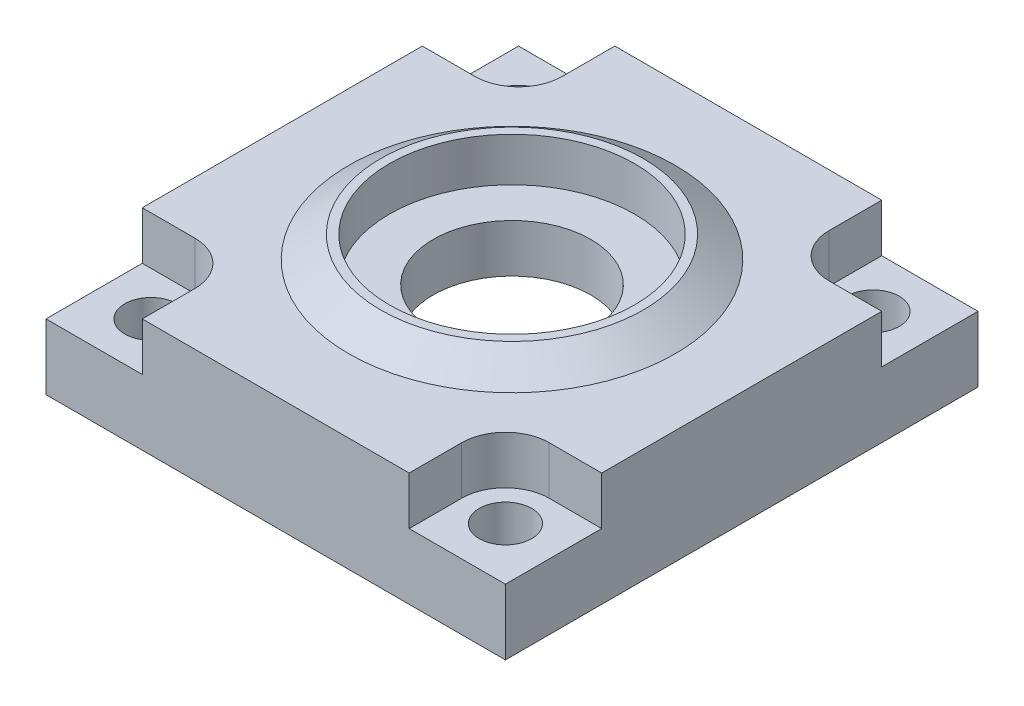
ISO-10303-21;
HEADER;
FILE_DESCRIPTION(('STEP AP214'),'2;1');
FILE_NAME('part.step','',(''),(''),'','','');
FILE_SCHEMA(('AUTOMOTIVE_DESIGN { 1 0 10303 214 1 1 1 1 }'));
ENDSEC;
DATA;
#1=APPLICATION_CONTEXT('core data for automotive mechanical design processes');
#2=APPLICATION_PROTOCOL_DEFINITION('international standard','automotive_design',2000,#1);
#3=PRODUCT_CONTEXT('',#1,'mechanical');
#4=PRODUCT('Part','Part','',(#3));
#5=PRODUCT_RELATED_PRODUCT_CATEGORY('part','',(#4));
#6=PRODUCT_DEFINITION_FORMATION('','',#4);
#7=PRODUCT_DEFINITION_CONTEXT('part definition',#1,'design');
#8=PRODUCT_DEFINITION('design','',#6,#7);
#9=PRODUCT_DEFINITION_SHAPE('','',#8);
#10=(LENGTH_UNIT() NAMED_UNIT(*) SI_UNIT(.MILLI.,.METRE.));
#11=(NAMED_UNIT(*) PLANE_ANGLE_UNIT() SI_UNIT($,.RADIAN.));
#12=(NAMED_UNIT(*) SI_UNIT($,.STERADIAN.) SOLID_ANGLE_UNIT());
#13=UNCERTAINTY_MEASURE_WITH_UNIT(LENGTH_MEASURE(1.E-05),#10,'distance_accuracy_value','');
#14=(GEOMETRIC_REPRESENTATION_CONTEXT(3) GLOBAL_UNCERTAINTY_ASSIGNED_CONTEXT((#13)) GLOBAL_UNIT_ASSIGNED_CONTEXT((#10,
#11,#12)) REPRESENTATION_CONTEXT('',''));
#15=CARTESIAN_POINT('',(0.,0.,0.));
#16=DIRECTION('',(0.,0.,1.));
#17=DIRECTION('',(1.,0.,0.));
#18=AXIS2_PLACEMENT_3D('',#15,#16,#17);
#19=CARTESIAN_POINT('',(0.,0.,-54.));
#20=DIRECTION('',(0.,-1.,0.));
#21=DIRECTION('',(0.,0.,-1.));
#22=AXIS2_PLACEMENT_3D('',#19,#20,#21);
#23=PLANE('',#22);
#24=CARTESIAN_POINT('',(46.5,0.,-48.));
#25=DIRECTION('',(0.,1.,0.));
#26=DIRECTION('',(0.,0.,-1.));
#27=AXIS2_PLACEMENT_3D('',#24,#25,#26);
#28=CIRCLE('',#27,3.);
#29=CARTESIAN_POINT('',(46.5,0.,-51.));
#30=VERTEX_POINT('',#29);
#31=EDGE_CURVE('E180',#30,#30,#28,.T.);
#32=ORIENTED_EDGE('',*,*,#31,.T.);
#33=EDGE_LOOP('',(#32));
#34=FACE_BOUND('',#33,.T.);
#35=CARTESIAN_POINT('',(46.5,0.,-6.));
#36=DIRECTION('',(0.,-1.,0.));
#37=DIRECTION('',(0.,0.,1.));
#38=AXIS2_PLACEMENT_3D('',#35,#36,#37);
#39=CIRCLE('',#38,3.);
#40=CARTESIAN_POINT('',(46.5,0.,-3.));
#41=VERTEX_POINT('',#40);
#42=EDGE_CURVE('E609',#41,#41,#39,.T.);
#43=ORIENTED_EDGE('',*,*,#42,.F.);
#44=EDGE_LOOP('',(#43));
#45=FACE_BOUND('',#44,.T.);
#46=CARTESIAN_POINT('',(6.,0.,-6.));
#47=DIRECTION('',(0.,1.,0.));
#48=DIRECTION('',(0.,0.,1.));
#49=AXIS2_PLACEMENT_3D('',#46,#47,#48);
#50=CIRCLE('',#49,3.);
#51=CARTESIAN_POINT('',(6.,0.,-3.));
#52=VERTEX_POINT('',#51);
#53=EDGE_CURVE('E522',#52,#52,#50,.T.);
#54=ORIENTED_EDGE('',*,*,#53,.T.);
#55=EDGE_LOOP('',(#54));
#56=FACE_BOUND('',#55,.T.);
#57=DIRECTION('',(1.,0.,0.));
#58=VECTOR('',#57,1.);
#59=CARTESIAN_POINT('',(0.,0.,0.));
#60=LINE('',#59,#58);
#61=CARTESIAN_POINT('',(0.,0.,0.));
#62=VERTEX_POINT('',#61);
#63=CARTESIAN_POINT('',(52.5,0.,0.));
#64=VERTEX_POINT('',#63);
#65=EDGE_CURVE('E560',#62,#64,#60,.T.);
#66=ORIENTED_EDGE('',*,*,#65,.F.);
#67=DIRECTION('',(0.,0.,1.));
#68=VECTOR('',#67,1.);
#69=CARTESIAN_POINT('',(0.,0.,-54.));
#70=LINE('',#69,#68);
#71=CARTESIAN_POINT('',(0.,0.,-54.));
#72=VERTEX_POINT('',#71);
#73=EDGE_CURVE('E187',#72,#62,#70,.T.);
#74=ORIENTED_EDGE('',*,*,#73,.F.);
#75=DIRECTION('',(1.,0.,0.));
#76=VECTOR('',#75,1.);
#77=CARTESIAN_POINT('',(0.,0.,-54.));
#78=LINE('',#77,#76);
#79=CARTESIAN_POINT('',(52.5,0.,-54.));
#80=VERTEX_POINT('',#79);
#81=EDGE_CURVE('E194',#72,#80,#78,.T.);
#82=ORIENTED_EDGE('',*,*,#81,.T.);
#83=DIRECTION('',(0.,0.,1.));
#84=VECTOR('',#83,1.);
#85=CARTESIAN_POINT('',(52.5,0.,-54.));
#86=LINE('',#85,#84);
#87=EDGE_CURVE('E191',#80,#64,#86,.T.);
#88=ORIENTED_EDGE('',*,*,#87,.T.);
#89=EDGE_LOOP('',(#66,#74,#82,#88));
#90=FACE_BOUND('',#89,.T.);
#91=CARTESIAN_POINT('',(26.25,0.,-27.));
#92=DIRECTION('',(0.,1.,0.));
#93=DIRECTION('',(0.,0.,1.));
#94=AXIS2_PLACEMENT_3D('',#91,#92,#93);
#95=CIRCLE('',#94,18.5);
#96=CARTESIAN_POINT('',(26.25,0.,-8.5));
#97=VERTEX_POINT('',#96);
#98=EDGE_CURVE('E535',#97,#97,#95,.T.);
#99=ORIENTED_EDGE('',*,*,#98,.T.);
#100=EDGE_LOOP('',(#99));
#101=FACE_BOUND('',#100,.T.);
#102=CARTESIAN_POINT('',(6.,0.,-48.));
#103=DIRECTION('',(0.,-1.,0.));
#104=DIRECTION('',(0.,0.,-1.));
#105=AXIS2_PLACEMENT_3D('',#102,#103,#104);
#106=CIRCLE('',#105,3.);
#107=CARTESIAN_POINT('',(6.,0.,-51.));
#108=VERTEX_POINT('',#107);
#109=EDGE_CURVE('E661',#108,#108,#106,.T.);
#110=ORIENTED_EDGE('',*,*,#109,.F.);
#111=EDGE_LOOP('',(#110));
#112=FACE_BOUND('',#111,.T.);
#113=ADVANCED_FACE('F29',(#34,#45,#56,#90,#101,#112),#23,.T.);
#114=CARTESIAN_POINT('',(0.,7.5,-43.));
#115=DIRECTION('',(0.,-1.,0.));
#116=DIRECTION('',(0.,0.,1.));
#117=AXIS2_PLACEMENT_3D('',#114,#115,#116);
#118=PLANE('',#117);
#119=DIRECTION('',(-1.,0.,0.));
#120=VECTOR('',#119,1.);
#121=CARTESIAN_POINT('',(0.,7.5,-43.));
#122=LINE('',#121,#120);
#123=CARTESIAN_POINT('',(5.99999999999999,7.5,-43.));
#124=VERTEX_POINT('',#123);
#125=CARTESIAN_POINT('',(0.,7.5,-43.));
#126=VERTEX_POINT('',#125);
#127=EDGE_CURVE('E592',#124,#126,#122,.T.);
#128=ORIENTED_EDGE('',*,*,#127,.F.);
#129=CARTESIAN_POINT('',(6.,7.5,-48.));
#130=DIRECTION('',(0.,-1.,0.));
#131=DIRECTION('',(0.,0.,-1.));
#132=AXIS2_PLACEMENT_3D('',#129,#130,#131);
#133=CIRCLE('',#132,5.);
#134=CARTESIAN_POINT('',(11.,7.5,-48.));
#135=VERTEX_POINT('',#134);
#136=EDGE_CURVE('E229',#124,#135,#133,.F.);
#137=ORIENTED_EDGE('',*,*,#136,.T.);
#138=DIRECTION('',(0.,0.,1.));
#139=VECTOR('',#138,1.);
#140=CARTESIAN_POINT('',(11.,7.5,-54.));
#141=LINE('',#140,#139);
#142=CARTESIAN_POINT('',(11.,7.5,-54.));
#143=VERTEX_POINT('',#142);
#144=EDGE_CURVE('E595',#143,#135,#141,.T.);
#145=ORIENTED_EDGE('',*,*,#144,.F.);
#146=DIRECTION('',(1.,0.,0.));
#147=VECTOR('',#146,1.);
#148=CARTESIAN_POINT('',(0.,7.5,-54.));
#149=LINE('',#148,#147);
#150=CARTESIAN_POINT('',(0.,7.5,-54.));
#151=VERTEX_POINT('',#150);
#152=EDGE_CURVE('E602',#151,#143,#149,.T.);
#153=ORIENTED_EDGE('',*,*,#152,.F.);
#154=DIRECTION('',(0.,0.,-1.));
#155=VECTOR('',#154,1.);
#156=CARTESIAN_POINT('',(0.,7.5,-54.));
#157=LINE('',#156,#155);
#158=EDGE_CURVE('E590',#126,#151,#157,.T.);
#159=ORIENTED_EDGE('',*,*,#158,.F.);
#160=EDGE_LOOP('',(#128,#137,#145,#153,#159));
#161=FACE_BOUND('',#160,.T.);
#162=CARTESIAN_POINT('',(6.,7.5,-48.));
#163=DIRECTION('',(0.,-1.,0.));
#164=DIRECTION('',(0.,0.,-1.));
#165=AXIS2_PLACEMENT_3D('',#162,#163,#164);
#166=CIRCLE('',#165,3.);
#167=CARTESIAN_POINT('',(6.,7.5,-51.));
#168=VERTEX_POINT('',#167);
#169=EDGE_CURVE('E657',#168,#168,#166,.T.);
#170=ORIENTED_EDGE('',*,*,#169,.T.);
#171=EDGE_LOOP('',(#170));
#172=FACE_BOUND('',#171,.T.);
#173=ADVANCED_FACE('F261',(#161,#172),#118,.F.);
#174=CARTESIAN_POINT('',(0.,13.,-54.));
#175=DIRECTION('',(0.,1.,0.));
#176=DIRECTION('',(0.,0.,1.));
#177=AXIS2_PLACEMENT_3D('',#174,#175,#176);
#178=PLANE('',#177);
#179=DIRECTION('',(1.,0.,0.));
#180=VECTOR('',#179,1.);
#181=CARTESIAN_POINT('',(52.5,13.,-43.));
#182=LINE('',#181,#180);
#183=CARTESIAN_POINT('',(46.5,13.,-43.));
#184=VERTEX_POINT('',#183);
#185=CARTESIAN_POINT('',(52.5,13.,-43.));
#186=VERTEX_POINT('',#185);
#187=EDGE_CURVE('E179',#184,#186,#182,.T.);
#188=ORIENTED_EDGE('',*,*,#187,.F.);
#189=CARTESIAN_POINT('',(46.5,13.,-48.));
#190=DIRECTION('',(0.,1.,0.));
#191=DIRECTION('',(0.,0.,1.));
#192=AXIS2_PLACEMENT_3D('',#189,#190,#191);
#193=CIRCLE('',#192,5.);
#194=CARTESIAN_POINT('',(41.5,13.,-48.));
#195=VERTEX_POINT('',#194);
#196=EDGE_CURVE('E11',#184,#195,#193,.F.);
#197=ORIENTED_EDGE('',*,*,#196,.T.);
#198=DIRECTION('',(0.,0.,1.));
#199=VECTOR('',#198,1.);
#200=CARTESIAN_POINT('',(41.5,13.,-54.));
#201=LINE('',#200,#199);
#202=CARTESIAN_POINT('',(41.5,13.,-54.));
#203=VERTEX_POINT('',#202);
#204=EDGE_CURVE('E165',#203,#195,#201,.T.);
#205=ORIENTED_EDGE('',*,*,#204,.F.);
#206=DIRECTION('',(-1.,0.,0.));
#207=VECTOR('',#206,1.);
#208=CARTESIAN_POINT('',(0.,13.,-54.));
#209=LINE('',#208,#207);
#210=CARTESIAN_POINT('',(11.,13.,-54.));
#211=VERTEX_POINT('',#210);
#212=EDGE_CURVE('E177',#203,#211,#209,.T.);
#213=ORIENTED_EDGE('',*,*,#212,.T.);
#214=DIRECTION('',(0.,0.,1.));
#215=VECTOR('',#214,1.);
#216=CARTESIAN_POINT('',(11.,13.,-54.));
#217=LINE('',#216,#215);
#218=CARTESIAN_POINT('',(11.,13.,-48.));
#219=VERTEX_POINT('',#218);
#220=EDGE_CURVE('E593',#211,#219,#217,.T.);
#221=ORIENTED_EDGE('',*,*,#220,.T.);
#222=CARTESIAN_POINT('',(6.,13.,-48.));
#223=DIRECTION('',(0.,1.,0.));
#224=DIRECTION('',(0.,0.,1.));
#225=AXIS2_PLACEMENT_3D('',#222,#223,#224);
#226=CIRCLE('',#225,5.);
#227=CARTESIAN_POINT('',(5.99999999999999,13.,-43.));
#228=VERTEX_POINT('',#227);
#229=EDGE_CURVE('E231',#219,#228,#226,.F.);
#230=ORIENTED_EDGE('',*,*,#229,.T.);
#231=DIRECTION('',(-1.,0.,0.));
#232=VECTOR('',#231,1.);
#233=CARTESIAN_POINT('',(0.,13.,-43.));
#234=LINE('',#233,#232);
#235=CARTESIAN_POINT('',(0.,13.,-43.));
#236=VERTEX_POINT('',#235);
#237=EDGE_CURVE('E513',#228,#236,#234,.T.);
#238=ORIENTED_EDGE('',*,*,#237,.T.);
#239=DIRECTION('',(0.,0.,1.));
#240=VECTOR('',#239,1.);
#241=CARTESIAN_POINT('',(0.,13.,-54.));
#242=LINE('',#241,#240);
#243=CARTESIAN_POINT('',(0.,13.,-11.));
#244=VERTEX_POINT('',#243);
#245=EDGE_CURVE('E198',#236,#244,#242,.T.);
#246=ORIENTED_EDGE('',*,*,#245,.T.);
#247=DIRECTION('',(-1.,0.,0.));
#248=VECTOR('',#247,1.);
#249=CARTESIAN_POINT('',(0.,13.,-11.));
#250=LINE('',#249,#248);
#251=CARTESIAN_POINT('',(5.99999999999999,13.,-11.));
#252=VERTEX_POINT('',#251);
#253=EDGE_CURVE('E511',#252,#244,#250,.T.);
#254=ORIENTED_EDGE('',*,*,#253,.F.);
#255=CARTESIAN_POINT('',(6.,13.,-6.));
#256=DIRECTION('',(0.,1.,0.));
#257=DIRECTION('',(0.,0.,1.));
#258=AXIS2_PLACEMENT_3D('',#255,#256,#257);
#259=CIRCLE('',#258,5.);
#260=CARTESIAN_POINT('',(11.,13.,-6.));
#261=VERTEX_POINT('',#260);
#262=EDGE_CURVE('E213',#252,#261,#259,.F.);
#263=ORIENTED_EDGE('',*,*,#262,.T.);
#264=DIRECTION('',(0.,0.,-1.));
#265=VECTOR('',#264,1.);
#266=CARTESIAN_POINT('',(11.,13.,0.));
#267=LINE('',#266,#265);
#268=CARTESIAN_POINT('',(11.,13.,0.));
#269=VERTEX_POINT('',#268);
#270=EDGE_CURVE('E517',#269,#261,#267,.T.);
#271=ORIENTED_EDGE('',*,*,#270,.F.);
#272=DIRECTION('',(-1.,0.,0.));
#273=VECTOR('',#272,1.);
#274=CARTESIAN_POINT('',(0.,13.,0.));
#275=LINE('',#274,#273);
#276=CARTESIAN_POINT('',(41.5,13.,0.));
#277=VERTEX_POINT('',#276);
#278=EDGE_CURVE('E566',#277,#269,#275,.T.);
#279=ORIENTED_EDGE('',*,*,#278,.F.);
#280=DIRECTION('',(0.,0.,-1.));
#281=VECTOR('',#280,1.);
#282=CARTESIAN_POINT('',(41.5,13.,0.));
#283=LINE('',#282,#281);
#284=CARTESIAN_POINT('',(41.5,13.,-6.));
#285=VERTEX_POINT('',#284);
#286=EDGE_CURVE('E615',#277,#285,#283,.T.);
#287=ORIENTED_EDGE('',*,*,#286,.T.);
#288=CARTESIAN_POINT('',(46.5,13.,-6.));
#289=DIRECTION('',(0.,1.,0.));
#290=DIRECTION('',(0.,0.,1.));
#291=AXIS2_PLACEMENT_3D('',#288,#289,#290);
#292=CIRCLE('',#291,5.);
#293=CARTESIAN_POINT('',(46.5,13.,-11.));
#294=VERTEX_POINT('',#293);
#295=EDGE_CURVE('E222',#285,#294,#292,.F.);
#296=ORIENTED_EDGE('',*,*,#295,.T.);
#297=DIRECTION('',(1.,0.,0.));
#298=VECTOR('',#297,1.);
#299=CARTESIAN_POINT('',(52.5,13.,-11.));
#300=LINE('',#299,#298);
#301=CARTESIAN_POINT('',(52.5,13.,-11.));
#302=VERTEX_POINT('',#301);
#303=EDGE_CURVE('E612',#294,#302,#300,.T.);
#304=ORIENTED_EDGE('',*,*,#303,.T.);
#305=DIRECTION('',(0.,0.,1.));
#306=VECTOR('',#305,1.);
#307=CARTESIAN_POINT('',(52.5,13.,-54.));
#308=LINE('',#307,#306);
#309=EDGE_CURVE('E201',#186,#302,#308,.T.);
#310=ORIENTED_EDGE('',*,*,#309,.F.);
#311=EDGE_LOOP('',(#188,#197,#205,#213,#221,#230,#238,#246,#254,#263,#271,#279,#287,#296,#304,#310));
#312=FACE_BOUND('',#311,.T.);
#313=CARTESIAN_POINT('',(26.25,13.,-27.));
#314=DIRECTION('',(0.,1.,0.));
#315=DIRECTION('',(0.,0.,1.));
#316=AXIS2_PLACEMENT_3D('',#313,#314,#315);
#317=CIRCLE('',#316,18.650692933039);
#318=CARTESIAN_POINT('',(26.25,13.,-8.34930706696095));
#319=VERTEX_POINT('',#318);
#320=EDGE_CURVE('E200',#319,#319,#317,.T.);
#321=ORIENTED_EDGE('',*,*,#320,.F.);
#322=EDGE_LOOP('',(#321));
#323=FACE_BOUND('',#322,.T.);
#324=ADVANCED_FACE('F174',(#312,#323),#178,.T.);
#325=CARTESIAN_POINT('',(0.,0.,-54.));
#326=DIRECTION('',(-1.,0.,0.));
#327=DIRECTION('',(0.,0.,1.));
#328=AXIS2_PLACEMENT_3D('',#325,#326,#327);
#329=PLANE('',#328);
#330=ORIENTED_EDGE('',*,*,#245,.F.);
#331=DIRECTION('',(0.,1.,0.));
#332=VECTOR('',#331,1.);
#333=CARTESIAN_POINT('',(0.,7.5,-43.));
#334=LINE('',#333,#332);
#335=EDGE_CURVE('E505',#126,#236,#334,.T.);
#336=ORIENTED_EDGE('',*,*,#335,.F.);
#337=ORIENTED_EDGE('',*,*,#158,.T.);
#338=DIRECTION('',(0.,-1.,0.));
#339=VECTOR('',#338,1.);
#340=CARTESIAN_POINT('',(0.,0.,-54.));
#341=LINE('',#340,#339);
#342=EDGE_CURVE('E568',#151,#72,#341,.T.);
#343=ORIENTED_EDGE('',*,*,#342,.T.);
#344=ORIENTED_EDGE('',*,*,#73,.T.);
#345=DIRECTION('',(0.,-1.,0.));
#346=VECTOR('',#345,1.);
#347=CARTESIAN_POINT('',(0.,0.,0.));
#348=LINE('',#347,#346);
#349=CARTESIAN_POINT('',(0.,7.5,0.));
#350=VERTEX_POINT('',#349);
#351=EDGE_CURVE('E558',#350,#62,#348,.T.);
#352=ORIENTED_EDGE('',*,*,#351,.F.);
#353=DIRECTION('',(0.,0.,1.));
#354=VECTOR('',#353,1.);
#355=CARTESIAN_POINT('',(0.,7.5,0.));
#356=LINE('',#355,#354);
#357=CARTESIAN_POINT('',(0.,7.5,-11.));
#358=VERTEX_POINT('',#357);
#359=EDGE_CURVE('E516',#358,#350,#356,.T.);
#360=ORIENTED_EDGE('',*,*,#359,.F.);
#361=DIRECTION('',(0.,1.,0.));
#362=VECTOR('',#361,1.);
#363=CARTESIAN_POINT('',(0.,7.5,-11.));
#364=LINE('',#363,#362);
#365=EDGE_CURVE('E508',#358,#244,#364,.T.);
#366=ORIENTED_EDGE('',*,*,#365,.T.);
#367=EDGE_LOOP('',(#330,#336,#337,#343,#344,#352,#360,#366));
#368=FACE_BOUND('',#367,.T.);
#369=ADVANCED_FACE('F31',(#368),#329,.T.);
#370=CARTESIAN_POINT('',(0.,13.,-54.));
#371=DIRECTION('',(0.,0.,-1.));
#372=DIRECTION('',(-1.,0.,0.));
#373=AXIS2_PLACEMENT_3D('',#370,#371,#372);
#374=PLANE('',#373);
#375=DIRECTION('',(0.,1.,0.));
#376=VECTOR('',#375,1.);
#377=CARTESIAN_POINT('',(41.5,7.5,-54.));
#378=LINE('',#377,#376);
#379=CARTESIAN_POINT('',(41.5,7.5,-54.));
#380=VERTEX_POINT('',#379);
#381=EDGE_CURVE('E163',#380,#203,#378,.T.);
#382=ORIENTED_EDGE('',*,*,#381,.F.);
#383=DIRECTION('',(-1.,0.,0.));
#384=VECTOR('',#383,1.);
#385=CARTESIAN_POINT('',(52.5,7.5,-54.));
#386=LINE('',#385,#384);
#387=CARTESIAN_POINT('',(52.5,7.5,-54.));
#388=VERTEX_POINT('',#387);
#389=EDGE_CURVE('E578',#388,#380,#386,.T.);
#390=ORIENTED_EDGE('',*,*,#389,.F.);
#391=DIRECTION('',(0.,1.,0.));
#392=VECTOR('',#391,1.);
#393=CARTESIAN_POINT('',(52.5,0.,-54.));
#394=LINE('',#393,#392);
#395=EDGE_CURVE('E188',#80,#388,#394,.T.);
#396=ORIENTED_EDGE('',*,*,#395,.F.);
#397=ORIENTED_EDGE('',*,*,#81,.F.);
#398=ORIENTED_EDGE('',*,*,#342,.F.);
#399=ORIENTED_EDGE('',*,*,#152,.T.);
#400=DIRECTION('',(0.,1.,0.));
#401=VECTOR('',#400,1.);
#402=CARTESIAN_POINT('',(11.,7.5,-54.));
#403=LINE('',#402,#401);
#404=EDGE_CURVE('E186',#143,#211,#403,.T.);
#405=ORIENTED_EDGE('',*,*,#404,.T.);
#406=ORIENTED_EDGE('',*,*,#212,.F.);
#407=EDGE_LOOP('',(#382,#390,#396,#397,#398,#399,#405,#406));
#408=FACE_BOUND('',#407,.T.);
#409=ADVANCED_FACE('F183',(#408),#374,.T.);
#410=CARTESIAN_POINT('',(52.5,7.5,-11.));
#411=DIRECTION('',(0.,-1.,0.));
#412=DIRECTION('',(0.,0.,-1.));
#413=AXIS2_PLACEMENT_3D('',#410,#411,#412);
#414=PLANE('',#413);
#415=DIRECTION('',(1.,0.,0.));
#416=VECTOR('',#415,1.);
#417=CARTESIAN_POINT('',(52.5,7.5,-11.));
#418=LINE('',#417,#416);
#419=CARTESIAN_POINT('',(46.5,7.5,-11.));
#420=VERTEX_POINT('',#419);
#421=CARTESIAN_POINT('',(52.5,7.5,-11.));
#422=VERTEX_POINT('',#421);
#423=EDGE_CURVE('E619',#420,#422,#418,.T.);
#424=ORIENTED_EDGE('',*,*,#423,.F.);
#425=CARTESIAN_POINT('',(46.5,7.5,-6.));
#426=DIRECTION('',(0.,-1.,0.));
#427=DIRECTION('',(0.,0.,-1.));
#428=AXIS2_PLACEMENT_3D('',#425,#426,#427);
#429=CIRCLE('',#428,5.);
#430=CARTESIAN_POINT('',(41.5,7.5,-6.));
#431=VERTEX_POINT('',#430);
#432=EDGE_CURVE('E220',#420,#431,#429,.F.);
#433=ORIENTED_EDGE('',*,*,#432,.T.);
#434=DIRECTION('',(0.,0.,-1.));
#435=VECTOR('',#434,1.);
#436=CARTESIAN_POINT('',(41.5,7.5,0.));
#437=LINE('',#436,#435);
#438=CARTESIAN_POINT('',(41.5,7.5,0.));
#439=VERTEX_POINT('',#438);
#440=EDGE_CURVE('E621',#439,#431,#437,.T.);
#441=ORIENTED_EDGE('',*,*,#440,.F.);
#442=DIRECTION('',(-1.,0.,0.));
#443=VECTOR('',#442,1.);
#444=CARTESIAN_POINT('',(52.5,7.5,0.));
#445=LINE('',#444,#443);
#446=CARTESIAN_POINT('',(52.5,7.5,0.));
#447=VERTEX_POINT('',#446);
#448=EDGE_CURVE('E624',#447,#439,#445,.T.);
#449=ORIENTED_EDGE('',*,*,#448,.F.);
#450=DIRECTION('',(0.,0.,1.));
#451=VECTOR('',#450,1.);
#452=CARTESIAN_POINT('',(52.5,7.5,0.));
#453=LINE('',#452,#451);
#454=EDGE_CURVE('E583',#422,#447,#453,.T.);
#455=ORIENTED_EDGE('',*,*,#454,.F.);
#456=EDGE_LOOP('',(#424,#433,#441,#449,#455));
#457=FACE_BOUND('',#456,.T.);
#458=CARTESIAN_POINT('',(46.5,7.5,-6.));
#459=DIRECTION('',(0.,-1.,0.));
#460=DIRECTION('',(0.,0.,1.));
#461=AXIS2_PLACEMENT_3D('',#458,#459,#460);
#462=CIRCLE('',#461,3.);
#463=CARTESIAN_POINT('',(46.5,7.5,-3.));
#464=VERTEX_POINT('',#463);
#465=EDGE_CURVE('E605',#464,#464,#462,.T.);
#466=ORIENTED_EDGE('',*,*,#465,.T.);
#467=EDGE_LOOP('',(#466));
#468=FACE_BOUND('',#467,.T.);
#469=ADVANCED_FACE('F275',(#457,#468),#414,.F.);
#470=CARTESIAN_POINT('',(52.5,0.,-54.));
#471=DIRECTION('',(1.,0.,0.));
#472=DIRECTION('',(0.,0.,-1.));
#473=AXIS2_PLACEMENT_3D('',#470,#471,#472);
#474=PLANE('',#473);
#475=DIRECTION('',(0.,1.,0.));
#476=VECTOR('',#475,1.);
#477=CARTESIAN_POINT('',(52.5,7.5,-43.));
#478=LINE('',#477,#476);
#479=CARTESIAN_POINT('',(52.5,7.5,-43.));
#480=VERTEX_POINT('',#479);
#481=EDGE_CURVE('E171',#480,#186,#478,.T.);
#482=ORIENTED_EDGE('',*,*,#481,.T.);
#483=ORIENTED_EDGE('',*,*,#309,.T.);
#484=DIRECTION('',(0.,1.,0.));
#485=VECTOR('',#484,1.);
#486=CARTESIAN_POINT('',(52.5,7.5,-11.));
#487=LINE('',#486,#485);
#488=EDGE_CURVE('E626',#422,#302,#487,.T.);
#489=ORIENTED_EDGE('',*,*,#488,.F.);
#490=ORIENTED_EDGE('',*,*,#454,.T.);
#491=DIRECTION('',(0.,1.,0.));
#492=VECTOR('',#491,1.);
#493=CARTESIAN_POINT('',(52.5,0.,0.));
#494=LINE('',#493,#492);
#495=EDGE_CURVE('E563',#64,#447,#494,.T.);
#496=ORIENTED_EDGE('',*,*,#495,.F.);
#497=ORIENTED_EDGE('',*,*,#87,.F.);
#498=ORIENTED_EDGE('',*,*,#395,.T.);
#499=DIRECTION('',(0.,0.,-1.));
#500=VECTOR('',#499,1.);
#501=CARTESIAN_POINT('',(52.5,7.5,-54.));
#502=LINE('',#501,#500);
#503=EDGE_CURVE('E579',#480,#388,#502,.T.);
#504=ORIENTED_EDGE('',*,*,#503,.F.);
#505=EDGE_LOOP('',(#482,#483,#489,#490,#496,#497,#498,#504));
#506=FACE_BOUND('',#505,.T.);
#507=ADVANCED_FACE('F271',(#506),#474,.T.);
#508=CARTESIAN_POINT('',(0.,13.,0.));
#509=DIRECTION('',(0.,0.,-1.));
#510=DIRECTION('',(-1.,0.,0.));
#511=AXIS2_PLACEMENT_3D('',#508,#509,#510);
#512=PLANE('',#511);
#513=DIRECTION('',(0.,1.,0.));
#514=VECTOR('',#513,1.);
#515=CARTESIAN_POINT('',(41.5,7.5,0.));
#516=LINE('',#515,#514);
#517=EDGE_CURVE('E627',#439,#277,#516,.T.);
#518=ORIENTED_EDGE('',*,*,#517,.T.);
#519=ORIENTED_EDGE('',*,*,#278,.T.);
#520=DIRECTION('',(0.,1.,0.));
#521=VECTOR('',#520,1.);
#522=CARTESIAN_POINT('',(11.,7.5,0.));
#523=LINE('',#522,#521);
#524=CARTESIAN_POINT('',(11.,7.5,0.));
#525=VERTEX_POINT('',#524);
#526=EDGE_CURVE('E533',#525,#269,#523,.T.);
#527=ORIENTED_EDGE('',*,*,#526,.F.);
#528=DIRECTION('',(1.,0.,0.));
#529=VECTOR('',#528,1.);
#530=CARTESIAN_POINT('',(0.,7.5,0.));
#531=LINE('',#530,#529);
#532=EDGE_CURVE('E519',#350,#525,#531,.T.);
#533=ORIENTED_EDGE('',*,*,#532,.F.);
#534=ORIENTED_EDGE('',*,*,#351,.T.);
#535=ORIENTED_EDGE('',*,*,#65,.T.);
#536=ORIENTED_EDGE('',*,*,#495,.T.);
#537=ORIENTED_EDGE('',*,*,#448,.T.);
#538=EDGE_LOOP('',(#518,#519,#527,#533,#534,#535,#536,#537));
#539=FACE_BOUND('',#538,.T.);
#540=ADVANCED_FACE('F274',(#539),#512,.F.);
#541=CARTESIAN_POINT('',(11.25,15.5,-27.));
#542=DIRECTION('',(0.,1.,0.));
#543=DIRECTION('',(0.,0.,1.));
#544=AXIS2_PLACEMENT_3D('',#541,#542,#543);
#545=PLANE('',#544);
#546=CARTESIAN_POINT('',(26.25,15.5,-27.));
#547=DIRECTION('',(0.,1.,0.));
#548=DIRECTION('',(0.,0.,1.));
#549=AXIS2_PLACEMENT_3D('',#546,#547,#548);
#550=CIRCLE('',#549,15.);
#551=CARTESIAN_POINT('',(26.25,15.5,-12.));
#552=VERTEX_POINT('',#551);
#553=EDGE_CURVE('E555',#552,#552,#550,.T.);
#554=ORIENTED_EDGE('',*,*,#553,.T.);
#555=EDGE_LOOP('',(#554));
#556=FACE_BOUND('',#555,.T.);
#557=CARTESIAN_POINT('',(26.25,15.5,-27.));
#558=DIRECTION('',(0.,1.,0.));
#559=DIRECTION('',(0.,0.,1.));
#560=AXIS2_PLACEMENT_3D('',#557,#558,#559);
#561=CIRCLE('',#560,14.);
#562=CARTESIAN_POINT('',(26.25,15.5,-13.));
#563=VERTEX_POINT('',#562);
#564=EDGE_CURVE('E552',#563,#563,#561,.T.);
#565=ORIENTED_EDGE('',*,*,#564,.F.);
#566=EDGE_LOOP('',(#565));
#567=FACE_BOUND('',#566,.T.);
#568=ADVANCED_FACE('F283',(#556,#567),#545,.T.);
#569=CARTESIAN_POINT('',(26.25,15.5,-27.));
#570=DIRECTION('',(0.,-1.,0.));
#571=DIRECTION('',(0.,0.,-1.));
#572=AXIS2_PLACEMENT_3D('',#569,#570,#571);
#573=CONICAL_SURFACE('',#572,15.,0.970343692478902);
#574=ORIENTED_EDGE('',*,*,#320,.T.);
#575=EDGE_LOOP('',(#574));
#576=FACE_BOUND('',#575,.T.);
#577=ORIENTED_EDGE('',*,*,#553,.F.);
#578=EDGE_LOOP('',(#577));
#579=FACE_BOUND('',#578,.T.);
#580=ADVANCED_FACE('F287',(#576,#579),#573,.T.);
#581=CARTESIAN_POINT('',(26.25,17.1514382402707,-27.));
#582=DIRECTION('',(0.,1.,0.));
#583=DIRECTION('',(0.,0.,1.));
#584=AXIS2_PLACEMENT_3D('',#581,#582,#583);
#585=CYLINDRICAL_SURFACE('',#584,14.);
#586=ORIENTED_EDGE('',*,*,#564,.T.);
#587=EDGE_LOOP('',(#586));
#588=FACE_BOUND('',#587,.T.);
#589=CARTESIAN_POINT('',(26.25,10.5,-27.));
#590=DIRECTION('',(0.,1.,0.));
#591=DIRECTION('',(0.,0.,1.));
#592=AXIS2_PLACEMENT_3D('',#589,#590,#591);
#593=CIRCLE('',#592,14.);
#594=CARTESIAN_POINT('',(26.25,10.5,-13.));
#595=VERTEX_POINT('',#594);
#596=EDGE_CURVE('E549',#595,#595,#593,.T.);
#597=ORIENTED_EDGE('',*,*,#596,.F.);
#598=EDGE_LOOP('',(#597));
#599=FACE_BOUND('',#598,.T.);
#600=ADVANCED_FACE('F291',(#588,#599),#585,.F.);
#601=CARTESIAN_POINT('',(40.25,10.5,-27.));
#602=DIRECTION('',(0.,1.,0.));
#603=DIRECTION('',(0.,0.,1.));
#604=AXIS2_PLACEMENT_3D('',#601,#602,#603);
#605=PLANE('',#604);
#606=ORIENTED_EDGE('',*,*,#596,.T.);
#607=EDGE_LOOP('',(#606));
#608=FACE_BOUND('',#607,.T.);
#609=CARTESIAN_POINT('',(26.25,10.5,-27.));
#610=DIRECTION('',(0.,1.,0.));
#611=DIRECTION('',(0.,0.,1.));
#612=AXIS2_PLACEMENT_3D('',#609,#610,#611);
#613=CIRCLE('',#612,9.00000000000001);
#614=CARTESIAN_POINT('',(26.25,10.5,-18.));
#615=VERTEX_POINT('',#614);
#616=EDGE_CURVE('E546',#615,#615,#613,.T.);
#617=ORIENTED_EDGE('',*,*,#616,.F.);
#618=EDGE_LOOP('',(#617));
#619=FACE_BOUND('',#618,.T.);
#620=ADVANCED_FACE('F295',(#608,#619),#605,.T.);
#621=CARTESIAN_POINT('',(26.25,17.1514382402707,-27.));
#622=DIRECTION('',(0.,1.,0.));
#623=DIRECTION('',(0.,0.,1.));
#624=AXIS2_PLACEMENT_3D('',#621,#622,#623);
#625=CYLINDRICAL_SURFACE('',#624,9.00000000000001);
#626=ORIENTED_EDGE('',*,*,#616,.T.);
#627=EDGE_LOOP('',(#626));
#628=FACE_BOUND('',#627,.T.);
#629=CARTESIAN_POINT('',(26.25,5.,-27.));
#630=DIRECTION('',(0.,1.,0.));
#631=DIRECTION('',(0.,0.,1.));
#632=AXIS2_PLACEMENT_3D('',#629,#630,#631);
#633=CIRCLE('',#632,9.00000000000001);
#634=CARTESIAN_POINT('',(26.25,5.,-18.));
#635=VERTEX_POINT('',#634);
#636=EDGE_CURVE('E543',#635,#635,#633,.T.);
#637=ORIENTED_EDGE('',*,*,#636,.F.);
#638=EDGE_LOOP('',(#637));
#639=FACE_BOUND('',#638,.T.);
#640=ADVANCED_FACE('F299',(#628,#639),#625,.F.);
#641=CARTESIAN_POINT('',(35.25,5.,-27.));
#642=DIRECTION('',(0.,-1.,0.));
#643=DIRECTION('',(0.,0.,-1.));
#644=AXIS2_PLACEMENT_3D('',#641,#642,#643);
#645=PLANE('',#644);
#646=ORIENTED_EDGE('',*,*,#636,.T.);
#647=EDGE_LOOP('',(#646));
#648=FACE_BOUND('',#647,.T.);
#649=CARTESIAN_POINT('',(26.25,5.,-27.));
#650=DIRECTION('',(0.,1.,0.));
#651=DIRECTION('',(0.,0.,1.));
#652=AXIS2_PLACEMENT_3D('',#649,#650,#651);
#653=CIRCLE('',#652,18.5);
#654=CARTESIAN_POINT('',(26.25,5.,-8.5));
#655=VERTEX_POINT('',#654);
#656=EDGE_CURVE('E540',#655,#655,#653,.T.);
#657=ORIENTED_EDGE('',*,*,#656,.F.);
#658=EDGE_LOOP('',(#657));
#659=FACE_BOUND('',#658,.T.);
#660=ADVANCED_FACE('F303',(#648,#659),#645,.T.);
#661=CARTESIAN_POINT('',(26.25,17.1514382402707,-27.));
#662=DIRECTION('',(0.,1.,0.));
#663=DIRECTION('',(0.,0.,1.));
#664=AXIS2_PLACEMENT_3D('',#661,#662,#663);
#665=CYLINDRICAL_SURFACE('',#664,18.5);
#666=ORIENTED_EDGE('',*,*,#656,.T.);
#667=EDGE_LOOP('',(#666));
#668=FACE_BOUND('',#667,.T.);
#669=ORIENTED_EDGE('',*,*,#98,.F.);
#670=EDGE_LOOP('',(#669));
#671=FACE_BOUND('',#670,.T.);
#672=ADVANCED_FACE('F307',(#668,#671),#665,.F.);
#673=CARTESIAN_POINT('',(0.,7.5,-11.));
#674=DIRECTION('',(0.,0.,-1.));
#675=DIRECTION('',(-1.,0.,0.));
#676=AXIS2_PLACEMENT_3D('',#673,#674,#675);
#677=PLANE('',#676);
#678=DIRECTION('',(-1.,0.,0.));
#679=VECTOR('',#678,1.);
#680=CARTESIAN_POINT('',(0.,7.5,-11.));
#681=LINE('',#680,#679);
#682=CARTESIAN_POINT('',(5.99999999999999,7.5,-11.));
#683=VERTEX_POINT('',#682);
#684=EDGE_CURVE('E531',#683,#358,#681,.T.);
#685=ORIENTED_EDGE('',*,*,#684,.F.);
#686=DIRECTION('',(0.,1.,0.));
#687=VECTOR('',#686,1.);
#688=CARTESIAN_POINT('',(5.99999999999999,13.,-11.));
#689=LINE('',#688,#687);
#690=EDGE_CURVE('E206',#683,#252,#689,.T.);
#691=ORIENTED_EDGE('',*,*,#690,.T.);
#692=ORIENTED_EDGE('',*,*,#253,.T.);
#693=ORIENTED_EDGE('',*,*,#365,.F.);
#694=EDGE_LOOP('',(#685,#691,#692,#693));
#695=FACE_BOUND('',#694,.T.);
#696=ADVANCED_FACE('F311',(#695),#677,.F.);
#697=CARTESIAN_POINT('',(11.,7.5,0.));
#698=DIRECTION('',(1.,0.,0.));
#699=DIRECTION('',(0.,0.,-1.));
#700=AXIS2_PLACEMENT_3D('',#697,#698,#699);
#701=PLANE('',#700);
#702=ORIENTED_EDGE('',*,*,#270,.T.);
#703=DIRECTION('',(0.,1.,0.));
#704=VECTOR('',#703,1.);
#705=CARTESIAN_POINT('',(11.,7.5,-6.));
#706=LINE('',#705,#704);
#707=CARTESIAN_POINT('',(11.,7.5,-6.));
#708=VERTEX_POINT('',#707);
#709=EDGE_CURVE('E209',#261,#708,#706,.F.);
#710=ORIENTED_EDGE('',*,*,#709,.T.);
#711=DIRECTION('',(0.,0.,-1.));
#712=VECTOR('',#711,1.);
#713=CARTESIAN_POINT('',(11.,7.5,0.));
#714=LINE('',#713,#712);
#715=EDGE_CURVE('E528',#525,#708,#714,.T.);
#716=ORIENTED_EDGE('',*,*,#715,.F.);
#717=ORIENTED_EDGE('',*,*,#526,.T.);
#718=EDGE_LOOP('',(#702,#710,#716,#717));
#719=FACE_BOUND('',#718,.T.);
#720=ADVANCED_FACE('F313',(#719),#701,.F.);
#721=CARTESIAN_POINT('',(0.,7.5,-11.));
#722=DIRECTION('',(0.,-1.,0.));
#723=DIRECTION('',(0.,0.,-1.));
#724=AXIS2_PLACEMENT_3D('',#721,#722,#723);
#725=PLANE('',#724);
#726=CARTESIAN_POINT('',(6.,7.5,-6.));
#727=DIRECTION('',(0.,1.,0.));
#728=DIRECTION('',(0.,0.,1.));
#729=AXIS2_PLACEMENT_3D('',#726,#727,#728);
#730=CIRCLE('',#729,3.);
#731=CARTESIAN_POINT('',(6.,7.5,-3.));
#732=VERTEX_POINT('',#731);
#733=EDGE_CURVE('E629',#732,#732,#730,.T.);
#734=ORIENTED_EDGE('',*,*,#733,.F.);
#735=EDGE_LOOP('',(#734));
#736=FACE_BOUND('',#735,.T.);
#737=ORIENTED_EDGE('',*,*,#715,.T.);
#738=CARTESIAN_POINT('',(6.,7.5,-6.));
#739=DIRECTION('',(0.,-1.,0.));
#740=DIRECTION('',(0.,0.,-1.));
#741=AXIS2_PLACEMENT_3D('',#738,#739,#740);
#742=CIRCLE('',#741,5.);
#743=EDGE_CURVE('E211',#708,#683,#742,.F.);
#744=ORIENTED_EDGE('',*,*,#743,.T.);
#745=ORIENTED_EDGE('',*,*,#684,.T.);
#746=ORIENTED_EDGE('',*,*,#359,.T.);
#747=ORIENTED_EDGE('',*,*,#532,.T.);
#748=EDGE_LOOP('',(#737,#744,#745,#746,#747));
#749=FACE_BOUND('',#748,.T.);
#750=ADVANCED_FACE('F316',(#736,#749),#725,.F.);
#751=CARTESIAN_POINT('',(6.,7.5,-6.));
#752=DIRECTION('',(0.,-1.,0.));
#753=DIRECTION('',(0.,0.,-1.));
#754=AXIS2_PLACEMENT_3D('',#751,#752,#753);
#755=CYLINDRICAL_SURFACE('',#754,5.);
#756=ORIENTED_EDGE('',*,*,#743,.F.);
#757=ORIENTED_EDGE('',*,*,#709,.F.);
#758=ORIENTED_EDGE('',*,*,#262,.F.);
#759=ORIENTED_EDGE('',*,*,#690,.F.);
#760=EDGE_LOOP('',(#756,#757,#758,#759));
#761=FACE_BOUND('',#760,.T.);
#762=ADVANCED_FACE('F323',(#761),#755,.F.);
#763=CARTESIAN_POINT('',(6.,0.,-6.));
#764=DIRECTION('',(0.,1.,0.));
#765=DIRECTION('',(0.,0.,1.));
#766=AXIS2_PLACEMENT_3D('',#763,#764,#765);
#767=CYLINDRICAL_SURFACE('',#766,3.);
#768=ORIENTED_EDGE('',*,*,#53,.F.);
#769=EDGE_LOOP('',(#768));
#770=FACE_BOUND('',#769,.T.);
#771=ORIENTED_EDGE('',*,*,#733,.T.);
#772=EDGE_LOOP('',(#771));
#773=FACE_BOUND('',#772,.T.);
#774=ADVANCED_FACE('F327',(#770,#773),#767,.F.);
#775=CARTESIAN_POINT('',(41.5,7.5,0.));
#776=DIRECTION('',(1.,0.,0.));
#777=DIRECTION('',(0.,0.,-1.));
#778=AXIS2_PLACEMENT_3D('',#775,#776,#777);
#779=PLANE('',#778);
#780=ORIENTED_EDGE('',*,*,#440,.T.);
#781=DIRECTION('',(0.,1.,0.));
#782=VECTOR('',#781,1.);
#783=CARTESIAN_POINT('',(41.5,13.,-6.));
#784=LINE('',#783,#782);
#785=EDGE_CURVE('E215',#431,#285,#784,.T.);
#786=ORIENTED_EDGE('',*,*,#785,.T.);
#787=ORIENTED_EDGE('',*,*,#286,.F.);
#788=ORIENTED_EDGE('',*,*,#517,.F.);
#789=EDGE_LOOP('',(#780,#786,#787,#788));
#790=FACE_BOUND('',#789,.T.);
#791=ADVANCED_FACE('F331',(#790),#779,.T.);
#792=CARTESIAN_POINT('',(52.5,7.5,-11.));
#793=DIRECTION('',(0.,0.,1.));
#794=DIRECTION('',(1.,0.,0.));
#795=AXIS2_PLACEMENT_3D('',#792,#793,#794);
#796=PLANE('',#795);
#797=ORIENTED_EDGE('',*,*,#303,.F.);
#798=DIRECTION('',(0.,1.,0.));
#799=VECTOR('',#798,1.);
#800=CARTESIAN_POINT('',(46.5,7.5,-11.));
#801=LINE('',#800,#799);
#802=EDGE_CURVE('E218',#294,#420,#801,.F.);
#803=ORIENTED_EDGE('',*,*,#802,.T.);
#804=ORIENTED_EDGE('',*,*,#423,.T.);
#805=ORIENTED_EDGE('',*,*,#488,.T.);
#806=EDGE_LOOP('',(#797,#803,#804,#805));
#807=FACE_BOUND('',#806,.T.);
#808=ADVANCED_FACE('F333',(#807),#796,.T.);
#809=CARTESIAN_POINT('',(46.5,7.5,-6.));
#810=DIRECTION('',(0.,-1.,0.));
#811=DIRECTION('',(0.,0.,-1.));
#812=AXIS2_PLACEMENT_3D('',#809,#810,#811);
#813=CYLINDRICAL_SURFACE('',#812,5.);
#814=ORIENTED_EDGE('',*,*,#432,.F.);
#815=ORIENTED_EDGE('',*,*,#802,.F.);
#816=ORIENTED_EDGE('',*,*,#295,.F.);
#817=ORIENTED_EDGE('',*,*,#785,.F.);
#818=EDGE_LOOP('',(#814,#815,#816,#817));
#819=FACE_BOUND('',#818,.T.);
#820=ADVANCED_FACE('F336',(#819),#813,.F.);
#821=CARTESIAN_POINT('',(46.5,0.,-6.));
#822=DIRECTION('',(0.,1.,0.));
#823=DIRECTION('',(0.,0.,1.));
#824=AXIS2_PLACEMENT_3D('',#821,#822,#823);
#825=CYLINDRICAL_SURFACE('',#824,3.);
#826=ORIENTED_EDGE('',*,*,#42,.T.);
#827=EDGE_LOOP('',(#826));
#828=FACE_BOUND('',#827,.T.);
#829=ORIENTED_EDGE('',*,*,#465,.F.);
#830=EDGE_LOOP('',(#829));
#831=FACE_BOUND('',#830,.T.);
#832=ADVANCED_FACE('F346',(#828,#831),#825,.F.);
#833=CARTESIAN_POINT('',(11.,7.5,-54.));
#834=DIRECTION('',(-1.,0.,0.));
#835=DIRECTION('',(0.,0.,1.));
#836=AXIS2_PLACEMENT_3D('',#833,#834,#835);
#837=PLANE('',#836);
#838=ORIENTED_EDGE('',*,*,#144,.T.);
#839=DIRECTION('',(0.,1.,0.));
#840=VECTOR('',#839,1.);
#841=CARTESIAN_POINT('',(11.,13.,-48.));
#842=LINE('',#841,#840);
#843=EDGE_CURVE('E224',#135,#219,#842,.T.);
#844=ORIENTED_EDGE('',*,*,#843,.T.);
#845=ORIENTED_EDGE('',*,*,#220,.F.);
#846=ORIENTED_EDGE('',*,*,#404,.F.);
#847=EDGE_LOOP('',(#838,#844,#845,#846));
#848=FACE_BOUND('',#847,.T.);
#849=ADVANCED_FACE('F350',(#848),#837,.T.);
#850=CARTESIAN_POINT('',(0.,7.5,-43.));
#851=DIRECTION('',(0.,0.,-1.));
#852=DIRECTION('',(-1.,0.,0.));
#853=AXIS2_PLACEMENT_3D('',#850,#851,#852);
#854=PLANE('',#853);
#855=ORIENTED_EDGE('',*,*,#237,.F.);
#856=DIRECTION('',(0.,1.,0.));
#857=VECTOR('',#856,1.);
#858=CARTESIAN_POINT('',(5.99999999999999,7.5,-43.));
#859=LINE('',#858,#857);
#860=EDGE_CURVE('E227',#228,#124,#859,.F.);
#861=ORIENTED_EDGE('',*,*,#860,.T.);
#862=ORIENTED_EDGE('',*,*,#127,.T.);
#863=ORIENTED_EDGE('',*,*,#335,.T.);
#864=EDGE_LOOP('',(#855,#861,#862,#863));
#865=FACE_BOUND('',#864,.T.);
#866=ADVANCED_FACE('F352',(#865),#854,.T.);
#867=CARTESIAN_POINT('',(6.,7.5,-48.));
#868=DIRECTION('',(0.,-1.,0.));
#869=DIRECTION('',(0.,0.,-1.));
#870=AXIS2_PLACEMENT_3D('',#867,#868,#869);
#871=CYLINDRICAL_SURFACE('',#870,5.);
#872=ORIENTED_EDGE('',*,*,#136,.F.);
#873=ORIENTED_EDGE('',*,*,#860,.F.);
#874=ORIENTED_EDGE('',*,*,#229,.F.);
#875=ORIENTED_EDGE('',*,*,#843,.F.);
#876=EDGE_LOOP('',(#872,#873,#874,#875));
#877=FACE_BOUND('',#876,.T.);
#878=ADVANCED_FACE('F355',(#877),#871,.F.);
#879=CARTESIAN_POINT('',(6.,0.,-48.));
#880=DIRECTION('',(0.,1.,0.));
#881=DIRECTION('',(0.,0.,1.));
#882=AXIS2_PLACEMENT_3D('',#879,#880,#881);
#883=CYLINDRICAL_SURFACE('',#882,3.);
#884=ORIENTED_EDGE('',*,*,#109,.T.);
#885=EDGE_LOOP('',(#884));
#886=FACE_BOUND('',#885,.T.);
#887=ORIENTED_EDGE('',*,*,#169,.F.);
#888=EDGE_LOOP('',(#887));
#889=FACE_BOUND('',#888,.T.);
#890=ADVANCED_FACE('F362',(#886,#889),#883,.F.);
#891=CARTESIAN_POINT('',(52.5,7.5,-43.));
#892=DIRECTION('',(0.,0.,1.));
#893=DIRECTION('',(1.,0.,0.));
#894=AXIS2_PLACEMENT_3D('',#891,#892,#893);
#895=PLANE('',#894);
#896=DIRECTION('',(1.,0.,0.));
#897=VECTOR('',#896,1.);
#898=CARTESIAN_POINT('',(52.5,7.5,-43.));
#899=LINE('',#898,#897);
#900=CARTESIAN_POINT('',(46.5,7.5,-43.));
#901=VERTEX_POINT('',#900);
#902=EDGE_CURVE('E172',#901,#480,#899,.T.);
#903=ORIENTED_EDGE('',*,*,#902,.F.);
#904=DIRECTION('',(0.,1.,0.));
#905=VECTOR('',#904,1.);
#906=CARTESIAN_POINT('',(46.5,13.,-43.));
#907=LINE('',#906,#905);
#908=EDGE_CURVE('E233',#901,#184,#907,.T.);
#909=ORIENTED_EDGE('',*,*,#908,.T.);
#910=ORIENTED_EDGE('',*,*,#187,.T.);
#911=ORIENTED_EDGE('',*,*,#481,.F.);
#912=EDGE_LOOP('',(#903,#909,#910,#911));
#913=FACE_BOUND('',#912,.T.);
#914=ADVANCED_FACE('F244',(#913),#895,.F.);
#915=CARTESIAN_POINT('',(41.5,7.5,-54.));
#916=DIRECTION('',(-1.,0.,0.));
#917=DIRECTION('',(0.,0.,1.));
#918=AXIS2_PLACEMENT_3D('',#915,#916,#917);
#919=PLANE('',#918);
#920=ORIENTED_EDGE('',*,*,#204,.T.);
#921=DIRECTION('',(0.,1.,0.));
#922=VECTOR('',#921,1.);
#923=CARTESIAN_POINT('',(41.5,7.5,-48.));
#924=LINE('',#923,#922);
#925=CARTESIAN_POINT('',(41.5,7.5,-48.));
#926=VERTEX_POINT('',#925);
#927=EDGE_CURVE('E44',#195,#926,#924,.F.);
#928=ORIENTED_EDGE('',*,*,#927,.T.);
#929=DIRECTION('',(0.,0.,1.));
#930=VECTOR('',#929,1.);
#931=CARTESIAN_POINT('',(41.5,7.5,-54.));
#932=LINE('',#931,#930);
#933=EDGE_CURVE('E166',#380,#926,#932,.T.);
#934=ORIENTED_EDGE('',*,*,#933,.F.);
#935=ORIENTED_EDGE('',*,*,#381,.T.);
#936=EDGE_LOOP('',(#920,#928,#934,#935));
#937=FACE_BOUND('',#936,.T.);
#938=ADVANCED_FACE('F164',(#937),#919,.F.);
#939=CARTESIAN_POINT('',(52.5,7.5,-43.));
#940=DIRECTION('',(0.,-1.,0.));
#941=DIRECTION('',(0.,0.,1.));
#942=AXIS2_PLACEMENT_3D('',#939,#940,#941);
#943=PLANE('',#942);
#944=CARTESIAN_POINT('',(46.5,7.5,-48.));
#945=DIRECTION('',(0.,1.,0.));
#946=DIRECTION('',(0.,0.,-1.));
#947=AXIS2_PLACEMENT_3D('',#944,#945,#946);
#948=CIRCLE('',#947,3.);
#949=CARTESIAN_POINT('',(46.5,7.5,-51.));
#950=VERTEX_POINT('',#949);
#951=EDGE_CURVE('E669',#950,#950,#948,.T.);
#952=ORIENTED_EDGE('',*,*,#951,.F.);
#953=EDGE_LOOP('',(#952));
#954=FACE_BOUND('',#953,.T.);
#955=ORIENTED_EDGE('',*,*,#933,.T.);
#956=CARTESIAN_POINT('',(46.5,7.5,-48.));
#957=DIRECTION('',(0.,-1.,0.));
#958=DIRECTION('',(0.,0.,-1.));
#959=AXIS2_PLACEMENT_3D('',#956,#957,#958);
#960=CIRCLE('',#959,5.);
#961=EDGE_CURVE('E37',#926,#901,#960,.F.);
#962=ORIENTED_EDGE('',*,*,#961,.T.);
#963=ORIENTED_EDGE('',*,*,#902,.T.);
#964=ORIENTED_EDGE('',*,*,#503,.T.);
#965=ORIENTED_EDGE('',*,*,#389,.T.);
#966=EDGE_LOOP('',(#955,#962,#963,#964,#965));
#967=FACE_BOUND('',#966,.T.);
#968=ADVANCED_FACE('F239',(#954,#967),#943,.F.);
#969=CARTESIAN_POINT('',(46.5,7.5,-48.));
#970=DIRECTION('',(0.,-1.,0.));
#971=DIRECTION('',(0.,0.,-1.));
#972=AXIS2_PLACEMENT_3D('',#969,#970,#971);
#973=CYLINDRICAL_SURFACE('',#972,5.);
#974=ORIENTED_EDGE('',*,*,#961,.F.);
#975=ORIENTED_EDGE('',*,*,#927,.F.);
#976=ORIENTED_EDGE('',*,*,#196,.F.);
#977=ORIENTED_EDGE('',*,*,#908,.F.);
#978=EDGE_LOOP('',(#974,#975,#976,#977));
#979=FACE_BOUND('',#978,.T.);
#980=ADVANCED_FACE('F248',(#979),#973,.F.);
#981=CARTESIAN_POINT('',(46.5,0.,-48.));
#982=DIRECTION('',(0.,1.,0.));
#983=DIRECTION('',(0.,0.,1.));
#984=AXIS2_PLACEMENT_3D('',#981,#982,#983);
#985=CYLINDRICAL_SURFACE('',#984,3.);
#986=ORIENTED_EDGE('',*,*,#31,.F.);
#987=EDGE_LOOP('',(#986));
#988=FACE_BOUND('',#987,.T.);
#989=ORIENTED_EDGE('',*,*,#951,.T.);
#990=EDGE_LOOP('',(#989));
#991=FACE_BOUND('',#990,.T.);
#992=ADVANCED_FACE('F250',(#988,#991),#985,.F.);
#993=CLOSED_SHELL('',(#113,#173,#324,#369,#409,#469,#507,#540,#568,#580,#600,#620,#640,#660,
#672,#696,#720,#750,#762,#774,#791,#808,#820,#832,#849,#866,#878,#890,#914,#938,#968,#980,#992));
#994=MANIFOLD_SOLID_BREP('B2',#993);
#995=ADVANCED_BREP_SHAPE_REPRESENTATION('',(#18,#994),#14);
#996=SHAPE_DEFINITION_REPRESENTATION(#9,#995);
ENDSEC;
END-ISO-10303-21;
